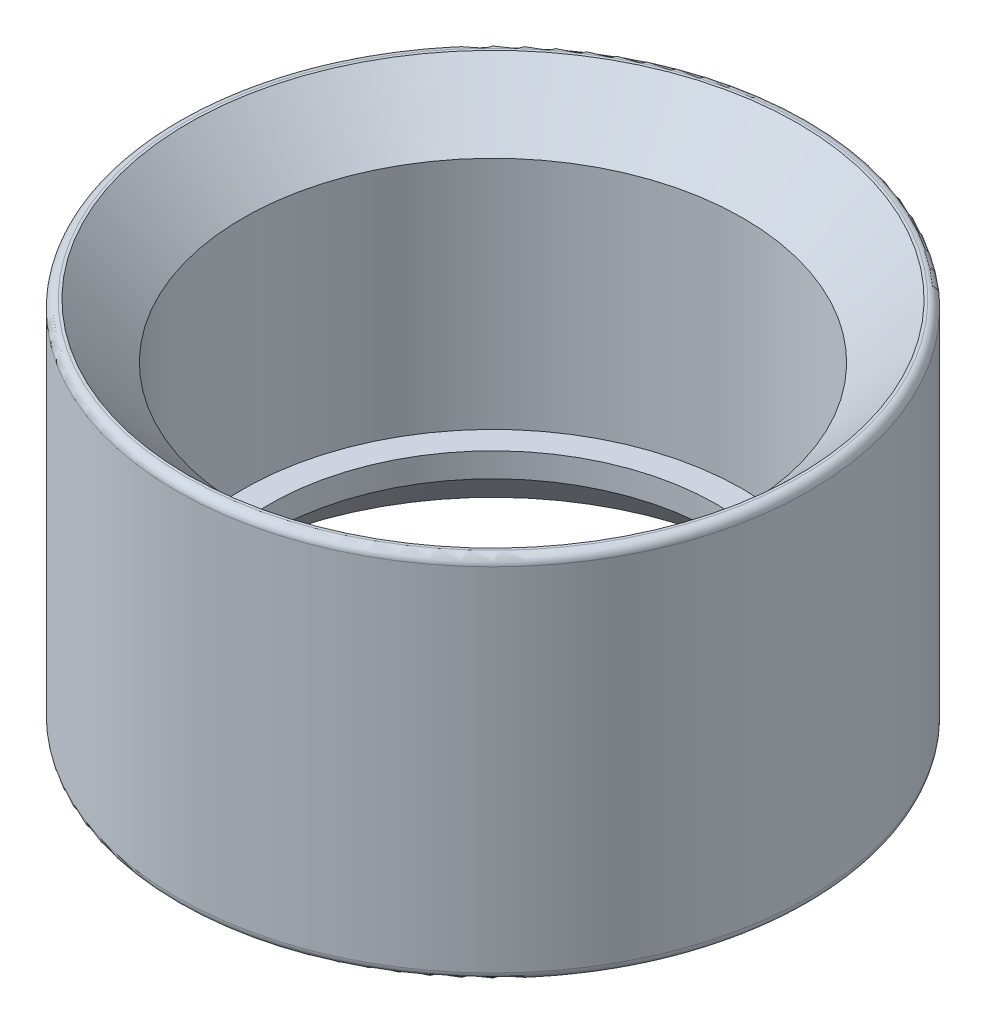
ISO-10303-21;
HEADER;
FILE_DESCRIPTION(('STEP AP214'),'2;1');
FILE_NAME('part.step','',(''),(''),'','','');
FILE_SCHEMA(('AUTOMOTIVE_DESIGN { 1 0 10303 214 1 1 1 1 }'));
ENDSEC;
DATA;
#1=APPLICATION_CONTEXT('core data for automotive mechanical design processes');
#2=APPLICATION_PROTOCOL_DEFINITION('international standard','automotive_design',2000,#1);
#3=PRODUCT_CONTEXT('',#1,'mechanical');
#4=PRODUCT('Part','Part','',(#3));
#5=PRODUCT_RELATED_PRODUCT_CATEGORY('part','',(#4));
#6=PRODUCT_DEFINITION_FORMATION('','',#4);
#7=PRODUCT_DEFINITION_CONTEXT('part definition',#1,'design');
#8=PRODUCT_DEFINITION('design','',#6,#7);
#9=PRODUCT_DEFINITION_SHAPE('','',#8);
#10=(LENGTH_UNIT() NAMED_UNIT(*) SI_UNIT(.MILLI.,.METRE.));
#11=(NAMED_UNIT(*) PLANE_ANGLE_UNIT() SI_UNIT($,.RADIAN.));
#12=(NAMED_UNIT(*) SI_UNIT($,.STERADIAN.) SOLID_ANGLE_UNIT());
#13=UNCERTAINTY_MEASURE_WITH_UNIT(LENGTH_MEASURE(1.E-05),#10,'distance_accuracy_value','');
#14=(GEOMETRIC_REPRESENTATION_CONTEXT(3) GLOBAL_UNCERTAINTY_ASSIGNED_CONTEXT((#13)) GLOBAL_UNIT_ASSIGNED_CONTEXT((#10,
#11,#12)) REPRESENTATION_CONTEXT('',''));
#15=CARTESIAN_POINT('',(0.,0.,0.));
#16=DIRECTION('',(0.,0.,1.));
#17=DIRECTION('',(1.,0.,0.));
#18=AXIS2_PLACEMENT_3D('',#15,#16,#17);
#19=CARTESIAN_POINT('',(0.,4.7625,0.));
#20=DIRECTION('',(0.,1.,0.));
#21=DIRECTION('',(0.,0.,1.));
#22=AXIS2_PLACEMENT_3D('',#19,#20,#21);
#23=PLANE('',#22);
#24=CARTESIAN_POINT('',(0.,4.7625,0.));
#25=DIRECTION('',(0.,1.,0.));
#26=DIRECTION('',(0.,0.,1.));
#27=AXIS2_PLACEMENT_3D('',#24,#25,#26);
#28=CIRCLE('',#27,15.08125);
#29=CARTESIAN_POINT('',(0.,4.7625,15.08125));
#30=VERTEX_POINT('',#29);
#31=EDGE_CURVE('E62',#30,#30,#28,.F.);
#32=ORIENTED_EDGE('',*,*,#31,.F.);
#33=EDGE_LOOP('',(#32));
#34=FACE_BOUND('',#33,.T.);
#35=CARTESIAN_POINT('',(0.,4.7625,0.));
#36=DIRECTION('',(0.,1.,0.));
#37=DIRECTION('',(0.,0.,1.));
#38=AXIS2_PLACEMENT_3D('',#35,#36,#37);
#39=CIRCLE('',#38,13.5001);
#40=CARTESIAN_POINT('',(0.,4.7625,-13.5001));
#41=VERTEX_POINT('',#40);
#42=EDGE_CURVE('E65',#41,#41,#39,.T.);
#43=ORIENTED_EDGE('',*,*,#42,.F.);
#44=EDGE_LOOP('',(#43));
#45=FACE_BOUND('',#44,.T.);
#46=ADVANCED_FACE('F30',(#34,#45),#23,.T.);
#47=CARTESIAN_POINT('',(0.,0.,0.));
#48=DIRECTION('',(0.,1.,0.));
#49=DIRECTION('',(0.,0.,1.));
#50=AXIS2_PLACEMENT_3D('',#47,#48,#49);
#51=PLANE('',#50);
#52=CARTESIAN_POINT('',(0.,0.,0.));
#53=DIRECTION('',(0.,1.,0.));
#54=DIRECTION('',(0.,0.,1.));
#55=AXIS2_PLACEMENT_3D('',#52,#53,#54);
#56=CIRCLE('',#55,18.542);
#57=CARTESIAN_POINT('',(0.,0.,18.542));
#58=VERTEX_POINT('',#57);
#59=EDGE_CURVE('E50',#58,#58,#56,.F.);
#60=ORIENTED_EDGE('',*,*,#59,.T.);
#61=EDGE_LOOP('',(#60));
#62=FACE_BOUND('',#61,.T.);
#63=CARTESIAN_POINT('',(0.,0.,0.));
#64=DIRECTION('',(0.,1.,0.));
#65=DIRECTION('',(0.,0.,1.));
#66=AXIS2_PLACEMENT_3D('',#63,#64,#65);
#67=CIRCLE('',#66,16.8021);
#68=CARTESIAN_POINT('',(0.,0.,-16.8021));
#69=VERTEX_POINT('',#68);
#70=EDGE_CURVE('E59',#69,#69,#67,.T.);
#71=ORIENTED_EDGE('',*,*,#70,.T.);
#72=EDGE_LOOP('',(#71));
#73=FACE_BOUND('',#72,.T.);
#74=ADVANCED_FACE('F72',(#62,#73),#51,.F.);
#75=CARTESIAN_POINT('',(0.,4.7625,0.));
#76=DIRECTION('',(0.,-1.,0.));
#77=DIRECTION('',(0.,0.,-1.));
#78=AXIS2_PLACEMENT_3D('',#75,#76,#77);
#79=CYLINDRICAL_SURFACE('',#78,19.05);
#80=CARTESIAN_POINT('',(0.,21.717,0.));
#81=DIRECTION('',(0.,1.,0.));
#82=DIRECTION('',(0.,0.,1.));
#83=AXIS2_PLACEMENT_3D('',#80,#81,#82);
#84=CIRCLE('',#83,19.05);
#85=CARTESIAN_POINT('',(0.,21.717,-19.05));
#86=VERTEX_POINT('',#85);
#87=EDGE_CURVE('E41',#86,#86,#84,.F.);
#88=CARTESIAN_POINT('',(0.,0.508,0.));
#89=DIRECTION('',(0.,1.,0.));
#90=DIRECTION('',(0.,0.,1.));
#91=AXIS2_PLACEMENT_3D('',#88,#89,#90);
#92=CIRCLE('',#91,19.05);
#93=CARTESIAN_POINT('',(0.,0.508,-19.05));
#94=VERTEX_POINT('',#93);
#95=EDGE_CURVE('E53',#94,#94,#92,.T.);
#96=CARTESIAN_POINT('',(0.,21.717,-19.05));
#97=CARTESIAN_POINT('',(0.,21.4960729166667,-19.05));
#98=CARTESIAN_POINT('',(0.,21.2751458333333,-19.05));
#99=CARTESIAN_POINT('',(0.,20.8332916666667,-19.05));
#100=CARTESIAN_POINT('',(0.,20.6123645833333,-19.05));
#101=CARTESIAN_POINT('',(0.,20.1705104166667,-19.05));
#102=CARTESIAN_POINT('',(0.,19.9495833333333,-19.05));
#103=CARTESIAN_POINT('',(0.,19.5077291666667,-19.05));
#104=CARTESIAN_POINT('',(0.,19.2868020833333,-19.05));
#105=CARTESIAN_POINT('',(0.,18.8449479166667,-19.05));
#106=CARTESIAN_POINT('',(0.,18.6240208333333,-19.05));
#107=CARTESIAN_POINT('',(0.,18.1821666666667,-19.05));
#108=CARTESIAN_POINT('',(0.,17.9612395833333,-19.05));
#109=CARTESIAN_POINT('',(0.,17.5193854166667,-19.05));
#110=CARTESIAN_POINT('',(0.,17.2984583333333,-19.05));
#111=CARTESIAN_POINT('',(0.,16.8566041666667,-19.05));
#112=CARTESIAN_POINT('',(0.,16.6356770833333,-19.05));
#113=CARTESIAN_POINT('',(0.,16.1938229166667,-19.05));
#114=CARTESIAN_POINT('',(0.,15.9728958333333,-19.05));
#115=CARTESIAN_POINT('',(0.,15.5310416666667,-19.05));
#116=CARTESIAN_POINT('',(0.,15.3101145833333,-19.05));
#117=CARTESIAN_POINT('',(0.,14.8682604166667,-19.05));
#118=CARTESIAN_POINT('',(0.,14.6473333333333,-19.05));
#119=CARTESIAN_POINT('',(0.,14.2054791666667,-19.05));
#120=CARTESIAN_POINT('',(0.,13.9845520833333,-19.05));
#121=CARTESIAN_POINT('',(0.,13.5426979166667,-19.05));
#122=CARTESIAN_POINT('',(0.,13.3217708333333,-19.05));
#123=CARTESIAN_POINT('',(0.,12.8799166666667,-19.05));
#124=CARTESIAN_POINT('',(0.,12.6589895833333,-19.05));
#125=CARTESIAN_POINT('',(0.,12.2171354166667,-19.05));
#126=CARTESIAN_POINT('',(0.,11.9962083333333,-19.05));
#127=CARTESIAN_POINT('',(0.,11.5543541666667,-19.05));
#128=CARTESIAN_POINT('',(0.,11.3334270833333,-19.05));
#129=CARTESIAN_POINT('',(0.,10.8915729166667,-19.05));
#130=CARTESIAN_POINT('',(0.,10.6706458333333,-19.05));
#131=CARTESIAN_POINT('',(0.,10.2287916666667,-19.05));
#132=CARTESIAN_POINT('',(0.,10.0078645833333,-19.05));
#133=CARTESIAN_POINT('',(0.,9.56601041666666,-19.05));
#134=CARTESIAN_POINT('',(0.,9.34508333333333,-19.05));
#135=CARTESIAN_POINT('',(0.,8.90322916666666,-19.05));
#136=CARTESIAN_POINT('',(0.,8.68230208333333,-19.05));
#137=CARTESIAN_POINT('',(0.,8.24044791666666,-19.05));
#138=CARTESIAN_POINT('',(0.,8.01952083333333,-19.05));
#139=CARTESIAN_POINT('',(0.,7.57766666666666,-19.05));
#140=CARTESIAN_POINT('',(0.,7.35673958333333,-19.05));
#141=CARTESIAN_POINT('',(0.,6.91488541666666,-19.05));
#142=CARTESIAN_POINT('',(0.,6.69395833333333,-19.05));
#143=CARTESIAN_POINT('',(0.,6.25210416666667,-19.05));
#144=CARTESIAN_POINT('',(0.,6.03117708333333,-19.05));
#145=CARTESIAN_POINT('',(0.,5.58932291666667,-19.05));
#146=CARTESIAN_POINT('',(0.,5.36839583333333,-19.05));
#147=CARTESIAN_POINT('',(0.,4.92654166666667,-19.05));
#148=CARTESIAN_POINT('',(0.,4.70561458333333,-19.05));
#149=CARTESIAN_POINT('',(0.,4.26376041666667,-19.05));
#150=CARTESIAN_POINT('',(0.,4.04283333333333,-19.05));
#151=CARTESIAN_POINT('',(0.,3.60097916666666,-19.05));
#152=CARTESIAN_POINT('',(0.,3.38005208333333,-19.05));
#153=CARTESIAN_POINT('',(0.,2.93819791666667,-19.05));
#154=CARTESIAN_POINT('',(0.,2.71727083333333,-19.05));
#155=CARTESIAN_POINT('',(0.,2.27541666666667,-19.05));
#156=CARTESIAN_POINT('',(0.,2.05448958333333,-19.05));
#157=CARTESIAN_POINT('',(0.,1.61263541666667,-19.05));
#158=CARTESIAN_POINT('',(0.,1.39170833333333,-19.05));
#159=CARTESIAN_POINT('',(0.,0.949854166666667,-19.05));
#160=CARTESIAN_POINT('',(0.,0.728927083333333,-19.05));
#161=CARTESIAN_POINT('',(0.,0.508,-19.05));
#162=B_SPLINE_CURVE_WITH_KNOTS('',3,(#96,#97,#98,#99,#100,#101,#102,#103,#104,#105,#106,#107,
#108,#109,#110,#111,#112,#113,#114,#115,#116,#117,#118,#119,#120,#121,#122,#123,#124,#125,#126,
#127,#128,#129,#130,#131,#132,#133,#134,#135,#136,#137,#138,#139,#140,#141,#142,#143,#144,#145,
#146,#147,#148,#149,#150,#151,#152,#153,#154,#155,#156,#157,#158,#159,#160,#161),.UNSPECIFIED.,
.F.,.F.,(4,2,2,2,2,2,2,2,2,2,2,2,2,2,2,2,2,2,2,2,2,2,2,2,2,2,2,2,2,2,2,2,4),(0.,
0.662781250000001,1.3255625,1.98834375,2.651125,3.31390625,3.9766875,4.63946875,5.30225,
5.96503125,6.6278125,7.29059375,7.95337499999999,8.61615625,9.2789375,9.94171875,10.6045,
11.26728125,11.9300625,12.59284375,13.255625,13.91840625,14.5811875,15.24396875,15.90675,
16.56953125,17.2323125,17.89509375,18.557875,19.22065625,19.8834375,20.54621875,21.209),.UNSPECIFIED.);
#163=EDGE_CURVE('BSEAM78',#86,#94,#162,.T.);
#164=ORIENTED_EDGE('',*,*,#87,.T.);
#165=ORIENTED_EDGE('',*,*,#95,.T.);
#166=ORIENTED_EDGE('',*,*,#163,.T.);
#167=ORIENTED_EDGE('',*,*,#163,.F.);
#168=EDGE_LOOP('',(#164,#166,#165,#167));
#169=FACE_BOUND('',#168,.T.);
#170=ADVANCED_FACE('F78',(#169),#79,.T.);
#171=CARTESIAN_POINT('',(0.,4.7625,0.));
#172=DIRECTION('',(0.,-1.,0.));
#173=DIRECTION('',(0.,0.,-1.));
#174=AXIS2_PLACEMENT_3D('',#171,#172,#173);
#175=CYLINDRICAL_SURFACE('',#174,13.5001);
#176=CARTESIAN_POINT('',(0.,3.30199999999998,0.));
#177=DIRECTION('',(0.,1.,0.));
#178=DIRECTION('',(0.,0.,1.));
#179=AXIS2_PLACEMENT_3D('',#176,#177,#178);
#180=CIRCLE('',#179,13.5001);
#181=CARTESIAN_POINT('',(0.,3.30199999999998,-13.5001));
#182=VERTEX_POINT('',#181);
#183=EDGE_CURVE('E56',#182,#182,#180,.F.);
#184=CARTESIAN_POINT('',(0.,3.30199999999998,-13.5001));
#185=CARTESIAN_POINT('',(0.,3.31721354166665,-13.5001));
#186=CARTESIAN_POINT('',(0.,3.33242708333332,-13.5001));
#187=CARTESIAN_POINT('',(0.,3.36285416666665,-13.5001));
#188=CARTESIAN_POINT('',(0.,3.37806770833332,-13.5001));
#189=CARTESIAN_POINT('',(0.,3.40849479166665,-13.5001));
#190=CARTESIAN_POINT('',(0.,3.42370833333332,-13.5001));
#191=CARTESIAN_POINT('',(0.,3.45413541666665,-13.5001));
#192=CARTESIAN_POINT('',(0.,3.46934895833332,-13.5001));
#193=CARTESIAN_POINT('',(0.,3.49977604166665,-13.5001));
#194=CARTESIAN_POINT('',(0.,3.51498958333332,-13.5001));
#195=CARTESIAN_POINT('',(0.,3.54541666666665,-13.5001));
#196=CARTESIAN_POINT('',(0.,3.56063020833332,-13.5001));
#197=CARTESIAN_POINT('',(0.,3.59105729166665,-13.5001));
#198=CARTESIAN_POINT('',(0.,3.60627083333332,-13.5001));
#199=CARTESIAN_POINT('',(0.,3.63669791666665,-13.5001));
#200=CARTESIAN_POINT('',(0.,3.65191145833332,-13.5001));
#201=CARTESIAN_POINT('',(0.,3.68233854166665,-13.5001));
#202=CARTESIAN_POINT('',(0.,3.69755208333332,-13.5001));
#203=CARTESIAN_POINT('',(0.,3.72797916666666,-13.5001));
#204=CARTESIAN_POINT('',(0.,3.74319270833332,-13.5001));
#205=CARTESIAN_POINT('',(0.,3.77361979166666,-13.5001));
#206=CARTESIAN_POINT('',(0.,3.78883333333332,-13.5001));
#207=CARTESIAN_POINT('',(0.,3.81926041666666,-13.5001));
#208=CARTESIAN_POINT('',(0.,3.83447395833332,-13.5001));
#209=CARTESIAN_POINT('',(0.,3.86490104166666,-13.5001));
#210=CARTESIAN_POINT('',(0.,3.88011458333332,-13.5001));
#211=CARTESIAN_POINT('',(0.,3.91054166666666,-13.5001));
#212=CARTESIAN_POINT('',(0.,3.92575520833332,-13.5001));
#213=CARTESIAN_POINT('',(0.,3.95618229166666,-13.5001));
#214=CARTESIAN_POINT('',(0.,3.97139583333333,-13.5001));
#215=CARTESIAN_POINT('',(0.,4.00182291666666,-13.5001));
#216=CARTESIAN_POINT('',(0.,4.01703645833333,-13.5001));
#217=CARTESIAN_POINT('',(0.,4.04746354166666,-13.5001));
#218=CARTESIAN_POINT('',(0.,4.06267708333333,-13.5001));
#219=CARTESIAN_POINT('',(0.,4.09310416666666,-13.5001));
#220=CARTESIAN_POINT('',(0.,4.10831770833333,-13.5001));
#221=CARTESIAN_POINT('',(0.,4.13874479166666,-13.5001));
#222=CARTESIAN_POINT('',(0.,4.15395833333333,-13.5001));
#223=CARTESIAN_POINT('',(0.,4.18438541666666,-13.5001));
#224=CARTESIAN_POINT('',(0.,4.19959895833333,-13.5001));
#225=CARTESIAN_POINT('',(0.,4.23002604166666,-13.5001));
#226=CARTESIAN_POINT('',(0.,4.24523958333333,-13.5001));
#227=CARTESIAN_POINT('',(0.,4.27566666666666,-13.5001));
#228=CARTESIAN_POINT('',(0.,4.29088020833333,-13.5001));
#229=CARTESIAN_POINT('',(0.,4.32130729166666,-13.5001));
#230=CARTESIAN_POINT('',(0.,4.33652083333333,-13.5001));
#231=CARTESIAN_POINT('',(0.,4.36694791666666,-13.5001));
#232=CARTESIAN_POINT('',(0.,4.38216145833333,-13.5001));
#233=CARTESIAN_POINT('',(0.,4.41258854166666,-13.5001));
#234=CARTESIAN_POINT('',(0.,4.42780208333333,-13.5001));
#235=CARTESIAN_POINT('',(0.,4.45822916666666,-13.5001));
#236=CARTESIAN_POINT('',(0.,4.47344270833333,-13.5001));
#237=CARTESIAN_POINT('',(0.,4.50386979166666,-13.5001));
#238=CARTESIAN_POINT('',(0.,4.51908333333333,-13.5001));
#239=CARTESIAN_POINT('',(0.,4.54951041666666,-13.5001));
#240=CARTESIAN_POINT('',(0.,4.56472395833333,-13.5001));
#241=CARTESIAN_POINT('',(0.,4.59515104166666,-13.5001));
#242=CARTESIAN_POINT('',(0.,4.61036458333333,-13.5001));
#243=CARTESIAN_POINT('',(0.,4.64079166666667,-13.5001));
#244=CARTESIAN_POINT('',(0.,4.65600520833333,-13.5001));
#245=CARTESIAN_POINT('',(0.,4.68643229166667,-13.5001));
#246=CARTESIAN_POINT('',(0.,4.70164583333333,-13.5001));
#247=CARTESIAN_POINT('',(0.,4.73207291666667,-13.5001));
#248=CARTESIAN_POINT('',(0.,4.74728645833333,-13.5001));
#249=CARTESIAN_POINT('',(0.,4.7625,-13.5001));
#250=B_SPLINE_CURVE_WITH_KNOTS('',3,(#184,#185,#186,#187,#188,#189,#190,#191,#192,#193,#194,
#195,#196,#197,#198,#199,#200,#201,#202,#203,#204,#205,#206,#207,#208,#209,#210,#211,#212,#213,
#214,#215,#216,#217,#218,#219,#220,#221,#222,#223,#224,#225,#226,#227,#228,#229,#230,#231,#232,
#233,#234,#235,#236,#237,#238,#239,#240,#241,#242,#243,#244,#245,#246,#247,#248,#249),
.UNSPECIFIED.,.F.,.F.,(4,2,2,2,2,2,2,2,2,2,2,2,2,2,2,2,2,2,2,2,2,2,2,2,2,2,2,2,2,2,2,2,4),(0.,
0.0456406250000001,0.0912812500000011,0.136921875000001,0.182562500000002,0.228203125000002,
0.273843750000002,0.319484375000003,0.365125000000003,0.410765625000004,0.456406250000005,
0.502046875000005,0.547687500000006,0.593328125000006,0.638968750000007,0.684609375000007,
0.730250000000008,0.775890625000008,0.821531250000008,0.867171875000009,0.912812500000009,
0.95845312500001,1.00409375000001,1.04973437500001,1.09537500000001,1.14101562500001,
1.18665625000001,1.23229687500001,1.27793750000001,1.32357812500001,1.36921875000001,
1.41485937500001,1.46050000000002),.UNSPECIFIED.);
#251=EDGE_CURVE('BSEAM69',#182,#41,#250,.T.);
#252=ORIENTED_EDGE('',*,*,#183,.T.);
#253=ORIENTED_EDGE('',*,*,#42,.T.);
#254=ORIENTED_EDGE('',*,*,#251,.T.);
#255=ORIENTED_EDGE('',*,*,#251,.F.);
#256=EDGE_LOOP('',(#252,#254,#253,#255));
#257=FACE_BOUND('',#256,.T.);
#258=ADVANCED_FACE('F69',(#257),#175,.F.);
#259=CARTESIAN_POINT('',(0.,22.225,0.));
#260=DIRECTION('',(0.,1.,0.));
#261=DIRECTION('',(0.,0.,1.));
#262=AXIS2_PLACEMENT_3D('',#259,#260,#261);
#263=PLANE('',#262);
#264=CARTESIAN_POINT('',(0.,22.225,0.));
#265=DIRECTION('',(0.,1.,0.));
#266=DIRECTION('',(0.,0.,1.));
#267=AXIS2_PLACEMENT_3D('',#264,#265,#266);
#268=CIRCLE('',#267,18.38325);
#269=CARTESIAN_POINT('',(0.,22.225,18.38325));
#270=VERTEX_POINT('',#269);
#271=EDGE_CURVE('E10',#270,#270,#268,.F.);
#272=ORIENTED_EDGE('',*,*,#271,.T.);
#273=EDGE_LOOP('',(#272));
#274=FACE_BOUND('',#273,.T.);
#275=CARTESIAN_POINT('',(0.,22.225,0.));
#276=DIRECTION('',(0.,1.,0.));
#277=DIRECTION('',(0.,0.,1.));
#278=AXIS2_PLACEMENT_3D('',#275,#276,#277);
#279=CIRCLE('',#278,18.542);
#280=CARTESIAN_POINT('',(0.,22.225,18.542));
#281=VERTEX_POINT('',#280);
#282=EDGE_CURVE('E45',#281,#281,#279,.T.);
#283=ORIENTED_EDGE('',*,*,#282,.T.);
#284=EDGE_LOOP('',(#283));
#285=FACE_BOUND('',#284,.T.);
#286=ADVANCED_FACE('F107',(#274,#285),#263,.T.);
#287=CARTESIAN_POINT('',(0.,22.225,0.));
#288=DIRECTION('',(0.,-1.,0.));
#289=DIRECTION('',(0.,0.,-1.));
#290=AXIS2_PLACEMENT_3D('',#287,#288,#289);
#291=CYLINDRICAL_SURFACE('',#290,15.08125);
#292=CARTESIAN_POINT('',(0.,18.923,0.));
#293=DIRECTION('',(0.,1.,0.));
#294=DIRECTION('',(0.,0.,1.));
#295=AXIS2_PLACEMENT_3D('',#292,#293,#294);
#296=CIRCLE('',#295,15.08125);
#297=CARTESIAN_POINT('',(0.,18.923,15.08125));
#298=VERTEX_POINT('',#297);
#299=EDGE_CURVE('E37',#298,#298,#296,.T.);
#300=ORIENTED_EDGE('',*,*,#299,.T.);
#301=EDGE_LOOP('',(#300));
#302=FACE_BOUND('',#301,.T.);
#303=ORIENTED_EDGE('',*,*,#31,.T.);
#304=EDGE_LOOP('',(#303));
#305=FACE_BOUND('',#304,.T.);
#306=ADVANCED_FACE('F92',(#302,#305),#291,.F.);
#307=CARTESIAN_POINT('',(0.,0.,0.));
#308=DIRECTION('',(0.,-1.,0.));
#309=DIRECTION('',(0.,0.,-1.));
#310=AXIS2_PLACEMENT_3D('',#307,#308,#309);
#311=CONICAL_SURFACE('',#310,16.8021,0.785398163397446);
#312=CARTESIAN_POINT('',(0.,3.30199999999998,-13.5001));
#313=CARTESIAN_POINT('',(0.,3.26760416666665,-13.5344958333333));
#314=CARTESIAN_POINT('',(0.,3.23320833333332,-13.5688916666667));
#315=CARTESIAN_POINT('',(0.,3.16441666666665,-13.6376833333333));
#316=CARTESIAN_POINT('',(0.,3.13002083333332,-13.6720791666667));
#317=CARTESIAN_POINT('',(0.,3.06122916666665,-13.7408708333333));
#318=CARTESIAN_POINT('',(0.,3.02683333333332,-13.7752666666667));
#319=CARTESIAN_POINT('',(0.,2.95804166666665,-13.8440583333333));
#320=CARTESIAN_POINT('',(0.,2.92364583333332,-13.8784541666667));
#321=CARTESIAN_POINT('',(0.,2.85485416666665,-13.9472458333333));
#322=CARTESIAN_POINT('',(0.,2.82045833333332,-13.9816416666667));
#323=CARTESIAN_POINT('',(0.,2.75166666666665,-14.0504333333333));
#324=CARTESIAN_POINT('',(0.,2.71727083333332,-14.0848291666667));
#325=CARTESIAN_POINT('',(0.,2.64847916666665,-14.1536208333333));
#326=CARTESIAN_POINT('',(0.,2.61408333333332,-14.1880166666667));
#327=CARTESIAN_POINT('',(0.,2.54529166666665,-14.2568083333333));
#328=CARTESIAN_POINT('',(0.,2.51089583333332,-14.2912041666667));
#329=CARTESIAN_POINT('',(0.,2.44210416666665,-14.3599958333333));
#330=CARTESIAN_POINT('',(0.,2.40770833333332,-14.3943916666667));
#331=CARTESIAN_POINT('',(0.,2.33891666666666,-14.4631833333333));
#332=CARTESIAN_POINT('',(0.,2.30452083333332,-14.4975791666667));
#333=CARTESIAN_POINT('',(0.,2.23572916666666,-14.5663708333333));
#334=CARTESIAN_POINT('',(0.,2.20133333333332,-14.6007666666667));
#335=CARTESIAN_POINT('',(0.,2.13254166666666,-14.6695583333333));
#336=CARTESIAN_POINT('',(0.,2.09814583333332,-14.7039541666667));
#337=CARTESIAN_POINT('',(0.,2.02935416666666,-14.7727458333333));
#338=CARTESIAN_POINT('',(0.,1.99495833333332,-14.8071416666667));
#339=CARTESIAN_POINT('',(0.,1.92616666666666,-14.8759333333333));
#340=CARTESIAN_POINT('',(0.,1.89177083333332,-14.9103291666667));
#341=CARTESIAN_POINT('',(0.,1.82297916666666,-14.9791208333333));
#342=CARTESIAN_POINT('',(0.,1.78858333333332,-15.0135166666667));
#343=CARTESIAN_POINT('',(0.,1.71979166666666,-15.0823083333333));
#344=CARTESIAN_POINT('',(0.,1.68539583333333,-15.1167041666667));
#345=CARTESIAN_POINT('',(0.,1.61660416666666,-15.1854958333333));
#346=CARTESIAN_POINT('',(0.,1.58220833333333,-15.2198916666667));
#347=CARTESIAN_POINT('',(0.,1.51341666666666,-15.2886833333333));
#348=CARTESIAN_POINT('',(0.,1.47902083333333,-15.3230791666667));
#349=CARTESIAN_POINT('',(0.,1.41022916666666,-15.3918708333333));
#350=CARTESIAN_POINT('',(0.,1.37583333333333,-15.4262666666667));
#351=CARTESIAN_POINT('',(0.,1.30704166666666,-15.4950583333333));
#352=CARTESIAN_POINT('',(0.,1.27264583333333,-15.5294541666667));
#353=CARTESIAN_POINT('',(0.,1.20385416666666,-15.5982458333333));
#354=CARTESIAN_POINT('',(0.,1.16945833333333,-15.6326416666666));
#355=CARTESIAN_POINT('',(0.,1.10066666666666,-15.7014333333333));
#356=CARTESIAN_POINT('',(0.,1.06627083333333,-15.7358291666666));
#357=CARTESIAN_POINT('',(0.,0.997479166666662,-15.8046208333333));
#358=CARTESIAN_POINT('',(0.,0.963083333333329,-15.8390166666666));
#359=CARTESIAN_POINT('',(0.,0.894291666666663,-15.9078083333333));
#360=CARTESIAN_POINT('',(0.,0.85989583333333,-15.9422041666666));
#361=CARTESIAN_POINT('',(0.,0.791104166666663,-16.0109958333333));
#362=CARTESIAN_POINT('',(0.,0.75670833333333,-16.0453916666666));
#363=CARTESIAN_POINT('',(0.,0.687916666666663,-16.1141833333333));
#364=CARTESIAN_POINT('',(0.,0.653520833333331,-16.1485791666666));
#365=CARTESIAN_POINT('',(0.,0.584729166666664,-16.2173708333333));
#366=CARTESIAN_POINT('',(0.,0.550333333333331,-16.2517666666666));
#367=CARTESIAN_POINT('',(0.,0.481541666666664,-16.3205583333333));
#368=CARTESIAN_POINT('',(0.,0.447145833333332,-16.3549541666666));
#369=CARTESIAN_POINT('',(0.,0.378354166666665,-16.4237458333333));
#370=CARTESIAN_POINT('',(0.,0.343958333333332,-16.4581416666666));
#371=CARTESIAN_POINT('',(0.,0.275166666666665,-16.5269333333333));
#372=CARTESIAN_POINT('',(0.,0.240770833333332,-16.5613291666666));
#373=CARTESIAN_POINT('',(0.,0.171979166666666,-16.6301208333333));
#374=CARTESIAN_POINT('',(0.,0.137583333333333,-16.6645166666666));
#375=CARTESIAN_POINT('',(0.,0.0687916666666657,-16.7333083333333));
#376=CARTESIAN_POINT('',(0.,0.0343958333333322,-16.7677041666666));
#377=CARTESIAN_POINT('',(0.,0.,-16.8021));
#378=B_SPLINE_CURVE_WITH_KNOTS('',3,(#312,#313,#314,#315,#316,#317,#318,#319,#320,#321,#322,
#323,#324,#325,#326,#327,#328,#329,#330,#331,#332,#333,#334,#335,#336,#337,#338,#339,#340,#341,
#342,#343,#344,#345,#346,#347,#348,#349,#350,#351,#352,#353,#354,#355,#356,#357,#358,#359,#360,
#361,#362,#363,#364,#365,#366,#367,#368,#369,#370,#371,#372,#373,#374,#375,#376,#377),
.UNSPECIFIED.,.F.,.F.,(4,2,2,2,2,2,2,2,2,2,2,2,2,2,2,2,2,2,2,2,2,2,2,2,2,2,2,2,2,2,2,2,4),(0.,
0.145929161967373,0.291858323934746,0.437787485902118,0.583716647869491,0.729645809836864,
0.875574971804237,1.02150413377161,1.16743329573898,1.31336245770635,1.45929161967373,
1.6052207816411,1.75114994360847,1.89707910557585,2.04300826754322,2.18893742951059,
2.33486659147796,2.48079575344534,2.62672491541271,2.77265407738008,2.91858323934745,
3.06451240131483,3.2104415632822,3.35637072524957,3.50229988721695,3.64822904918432,
3.79415821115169,3.94008737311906,4.08601653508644,4.23194569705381,4.37787485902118,
4.52380402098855,4.66973318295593),.UNSPECIFIED.);
#379=EDGE_CURVE('BSEAM88',#182,#69,#378,.T.);
#380=ORIENTED_EDGE('',*,*,#183,.F.);
#381=ORIENTED_EDGE('',*,*,#70,.F.);
#382=ORIENTED_EDGE('',*,*,#379,.T.);
#383=ORIENTED_EDGE('',*,*,#379,.F.);
#384=EDGE_LOOP('',(#380,#382,#381,#383));
#385=FACE_BOUND('',#384,.T.);
#386=ADVANCED_FACE('F88',(#385),#311,.F.);
#387=CARTESIAN_POINT('',(0.,0.508,0.));
#388=DIRECTION('',(0.,1.,0.));
#389=DIRECTION('',(0.,0.,1.));
#390=AXIS2_PLACEMENT_3D('',#387,#388,#389);
#391=TOROIDAL_SURFACE('',#390,18.542,0.508);
#392=ORIENTED_EDGE('',*,*,#59,.F.);
#393=EDGE_LOOP('',(#392));
#394=FACE_BOUND('',#393,.T.);
#395=ORIENTED_EDGE('',*,*,#95,.F.);
#396=EDGE_LOOP('',(#395));
#397=FACE_BOUND('',#396,.T.);
#398=ADVANCED_FACE('F91',(#394,#397),#391,.T.);
#399=CARTESIAN_POINT('',(0.,21.717,0.));
#400=DIRECTION('',(0.,1.,0.));
#401=DIRECTION('',(0.,0.,1.));
#402=AXIS2_PLACEMENT_3D('',#399,#400,#401);
#403=TOROIDAL_SURFACE('',#402,18.542,0.508);
#404=ORIENTED_EDGE('',*,*,#87,.F.);
#405=EDGE_LOOP('',(#404));
#406=FACE_BOUND('',#405,.T.);
#407=ORIENTED_EDGE('',*,*,#282,.F.);
#408=EDGE_LOOP('',(#407));
#409=FACE_BOUND('',#408,.T.);
#410=ADVANCED_FACE('F95',(#406,#409),#403,.T.);
#411=CARTESIAN_POINT('',(0.,18.923,0.));
#412=DIRECTION('',(0.,1.,0.));
#413=DIRECTION('',(0.,0.,1.));
#414=AXIS2_PLACEMENT_3D('',#411,#412,#413);
#415=CONICAL_SURFACE('',#414,15.08125,0.78539816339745);
#416=CARTESIAN_POINT('',(0.,22.225,18.38325));
#417=CARTESIAN_POINT('',(0.,22.1906041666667,18.3488541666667));
#418=CARTESIAN_POINT('',(0.,22.1562083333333,18.3144583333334));
#419=CARTESIAN_POINT('',(0.,22.0874166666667,18.2456666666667));
#420=CARTESIAN_POINT('',(0.,22.0530208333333,18.2112708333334));
#421=CARTESIAN_POINT('',(0.,21.9842291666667,18.1424791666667));
#422=CARTESIAN_POINT('',(0.,21.9498333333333,18.1080833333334));
#423=CARTESIAN_POINT('',(0.,21.8810416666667,18.0392916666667));
#424=CARTESIAN_POINT('',(0.,21.8466458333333,18.0048958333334));
#425=CARTESIAN_POINT('',(0.,21.7778541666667,17.9361041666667));
#426=CARTESIAN_POINT('',(0.,21.7434583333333,17.9017083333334));
#427=CARTESIAN_POINT('',(0.,21.6746666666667,17.8329166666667));
#428=CARTESIAN_POINT('',(0.,21.6402708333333,17.7985208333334));
#429=CARTESIAN_POINT('',(0.,21.5714791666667,17.7297291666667));
#430=CARTESIAN_POINT('',(0.,21.5370833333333,17.6953333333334));
#431=CARTESIAN_POINT('',(0.,21.4682916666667,17.6265416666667));
#432=CARTESIAN_POINT('',(0.,21.4338958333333,17.5921458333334));
#433=CARTESIAN_POINT('',(0.,21.3651041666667,17.5233541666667));
#434=CARTESIAN_POINT('',(0.,21.3307083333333,17.4889583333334));
#435=CARTESIAN_POINT('',(0.,21.2619166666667,17.4201666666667));
#436=CARTESIAN_POINT('',(0.,21.2275208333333,17.3857708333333));
#437=CARTESIAN_POINT('',(0.,21.1587291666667,17.3169791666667));
#438=CARTESIAN_POINT('',(0.,21.1243333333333,17.2825833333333));
#439=CARTESIAN_POINT('',(0.,21.0555416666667,17.2137916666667));
#440=CARTESIAN_POINT('',(0.,21.0211458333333,17.1793958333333));
#441=CARTESIAN_POINT('',(0.,20.9523541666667,17.1106041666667));
#442=CARTESIAN_POINT('',(0.,20.9179583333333,17.0762083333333));
#443=CARTESIAN_POINT('',(0.,20.8491666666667,17.0074166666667));
#444=CARTESIAN_POINT('',(0.,20.8147708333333,16.9730208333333));
#445=CARTESIAN_POINT('',(0.,20.7459791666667,16.9042291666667));
#446=CARTESIAN_POINT('',(0.,20.7115833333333,16.8698333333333));
#447=CARTESIAN_POINT('',(0.,20.6427916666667,16.8010416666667));
#448=CARTESIAN_POINT('',(0.,20.6083958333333,16.7666458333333));
#449=CARTESIAN_POINT('',(0.,20.5396041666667,16.6978541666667));
#450=CARTESIAN_POINT('',(0.,20.5052083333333,16.6634583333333));
#451=CARTESIAN_POINT('',(0.,20.4364166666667,16.5946666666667));
#452=CARTESIAN_POINT('',(0.,20.4020208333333,16.5602708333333));
#453=CARTESIAN_POINT('',(0.,20.3332291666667,16.4914791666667));
#454=CARTESIAN_POINT('',(0.,20.2988333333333,16.4570833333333));
#455=CARTESIAN_POINT('',(0.,20.2300416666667,16.3882916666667));
#456=CARTESIAN_POINT('',(0.,20.1956458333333,16.3538958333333));
#457=CARTESIAN_POINT('',(0.,20.1268541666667,16.2851041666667));
#458=CARTESIAN_POINT('',(0.,20.0924583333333,16.2507083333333));
#459=CARTESIAN_POINT('',(0.,20.0236666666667,16.1819166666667));
#460=CARTESIAN_POINT('',(0.,19.9892708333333,16.1475208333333));
#461=CARTESIAN_POINT('',(0.,19.9204791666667,16.0787291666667));
#462=CARTESIAN_POINT('',(0.,19.8860833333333,16.0443333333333));
#463=CARTESIAN_POINT('',(0.,19.8172916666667,15.9755416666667));
#464=CARTESIAN_POINT('',(0.,19.7828958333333,15.9411458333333));
#465=CARTESIAN_POINT('',(0.,19.7141041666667,15.8723541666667));
#466=CARTESIAN_POINT('',(0.,19.6797083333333,15.8379583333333));
#467=CARTESIAN_POINT('',(0.,19.6109166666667,15.7691666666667));
#468=CARTESIAN_POINT('',(0.,19.5765208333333,15.7347708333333));
#469=CARTESIAN_POINT('',(0.,19.5077291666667,15.6659791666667));
#470=CARTESIAN_POINT('',(0.,19.4733333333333,15.6315833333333));
#471=CARTESIAN_POINT('',(0.,19.4045416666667,15.5627916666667));
#472=CARTESIAN_POINT('',(0.,19.3701458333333,15.5283958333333));
#473=CARTESIAN_POINT('',(0.,19.3013541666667,15.4596041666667));
#474=CARTESIAN_POINT('',(0.,19.2669583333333,15.4252083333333));
#475=CARTESIAN_POINT('',(0.,19.1981666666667,15.3564166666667));
#476=CARTESIAN_POINT('',(0.,19.1637708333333,15.3220208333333));
#477=CARTESIAN_POINT('',(0.,19.0949791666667,15.2532291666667));
#478=CARTESIAN_POINT('',(0.,19.0605833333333,15.2188333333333));
#479=CARTESIAN_POINT('',(0.,18.9917916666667,15.1500416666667));
#480=CARTESIAN_POINT('',(0.,18.9573958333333,15.1156458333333));
#481=CARTESIAN_POINT('',(0.,18.923,15.08125));
#482=B_SPLINE_CURVE_WITH_KNOTS('',3,(#416,#417,#418,#419,#420,#421,#422,#423,#424,#425,#426,
#427,#428,#429,#430,#431,#432,#433,#434,#435,#436,#437,#438,#439,#440,#441,#442,#443,#444,#445,
#446,#447,#448,#449,#450,#451,#452,#453,#454,#455,#456,#457,#458,#459,#460,#461,#462,#463,#464,
#465,#466,#467,#468,#469,#470,#471,#472,#473,#474,#475,#476,#477,#478,#479,#480,#481),
.UNSPECIFIED.,.F.,.F.,(4,2,2,2,2,2,2,2,2,2,2,2,2,2,2,2,2,2,2,2,2,2,2,2,2,2,2,2,2,2,2,2,4),(0.,
0.145929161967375,0.29185832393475,0.437787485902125,0.5837166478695,0.729645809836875,
0.875574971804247,1.02150413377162,1.167433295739,1.31336245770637,1.45929161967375,
1.60522078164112,1.7511499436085,1.89707910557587,2.04300826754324,2.18893742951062,
2.33486659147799,2.48079575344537,2.62672491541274,2.77265407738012,2.91858323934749,
3.06451240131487,3.21044156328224,3.35637072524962,3.50229988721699,3.64822904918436,
3.79415821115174,3.94008737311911,4.08601653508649,4.23194569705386,4.37787485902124,
4.52380402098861,4.66973318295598),.UNSPECIFIED.);
#483=EDGE_CURVE('BSEAM32',#270,#298,#482,.T.);
#484=ORIENTED_EDGE('',*,*,#271,.F.);
#485=ORIENTED_EDGE('',*,*,#299,.F.);
#486=ORIENTED_EDGE('',*,*,#483,.T.);
#487=ORIENTED_EDGE('',*,*,#483,.F.);
#488=EDGE_LOOP('',(#484,#486,#485,#487));
#489=FACE_BOUND('',#488,.T.);
#490=ADVANCED_FACE('F32',(#489),#415,.F.);
#491=CLOSED_SHELL('',(#46,#74,#170,#258,#286,#306,#386,#398,#410,#490));
#492=MANIFOLD_SOLID_BREP('B2',#491);
#493=ADVANCED_BREP_SHAPE_REPRESENTATION('',(#18,#492),#14);
#494=SHAPE_DEFINITION_REPRESENTATION(#9,#493);
ENDSEC;
END-ISO-10303-21;
